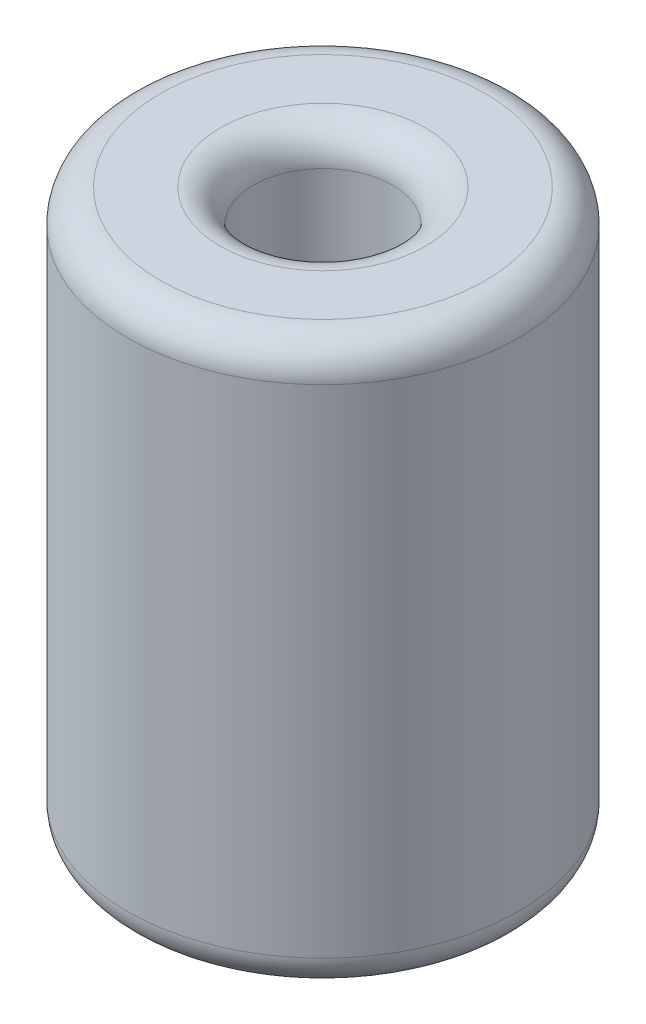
from build123d import *

# Parameters (mm, degrees)
SKETCH1_R           = 2.95
BOSS_EXTRUDE1_DEPTH = 4.25
FILLET1_R           = 0.5
SKETCH2_R           = 1.5
CUT_EXTRUDE1_DEPTH  = 7.824038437
SKETCH3_R           = 1.05
CUT_EXTRUDE2_DEPTH  = 10.468632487
FILLET2_R           = 0.5


with BuildPart() as part:
    # Sketch1 → Boss-Extrude1 (new, symmetric)
    with BuildSketch(Plane(origin=(0, 0, 0), x_dir=(1, 0, 0), z_dir=(0, 1, 0))):
        with Locations(Location((0, 0, 0), (0, 0, 270))):
            Circle(SKETCH1_R)
    extrude(amount=BOSS_EXTRUDE1_DEPTH, both=True)

    # Fillet1
    fillet1_edges = [part.edges().sort_by_distance(p)[0] for p in [
        (0, -4.25, -2.95),
        (0, 4.25, -2.95),
    ]]
    fillet(fillet1_edges, radius=FILLET1_R)

    # Sketch2 → Cut-Extrude1 (cut, through all)
    with BuildSketch(Plane(origin=(-1.5, 0, 0), x_dir=(0, 0, -1), z_dir=(1, 0, 0))):
        Circle(SKETCH2_R)
    extrude(amount=-CUT_EXTRUDE1_DEPTH, mode=Mode.SUBTRACT)

    # Sketch3 → Cut-Extrude2 (cut, through all)
    with BuildSketch(Plane(origin=(0, 4.25, 0), x_dir=(1, 0, 0), z_dir=(0, 1, 0))):
        with Locations(Location((0, 0, 0), (0, 0, 270))):
            Circle(SKETCH3_R)
    extrude(amount=-CUT_EXTRUDE2_DEPTH, mode=Mode.SUBTRACT)

    # Fillet2
    fillet2_edges = [part.edges().sort_by_distance(p)[0] for p in [
        (0, -4.25, -1.05),
        (0, 4.25, -1.05),
    ]]
    fillet(fillet2_edges, radius=FILLET2_R)


solid = part.part
